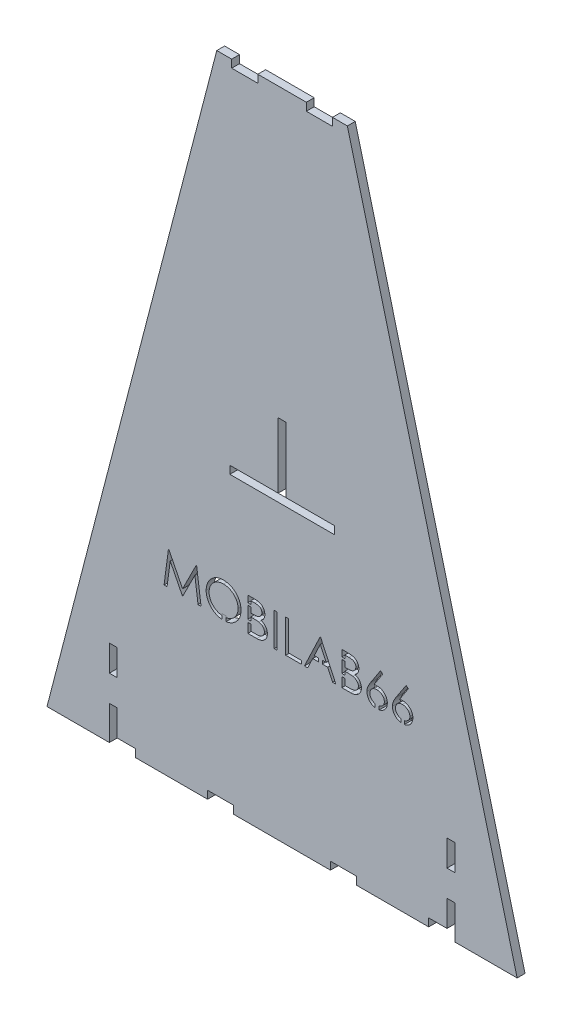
from build123d import *

# Parameters (mm, degrees)
BOSS_EXTRU_1_DEPTH      = 3
ESQUISSE2_W             = 3
ESQUISSE2_H             = 10
ENL_V_MAT_EXTRU_1_DEPTH = 248
ESQUISSE3_W             = 10
ESQUISSE3_H             = 3
ENL_V_MAT_EXTRU_2_DEPTH = 120
ESQUISSE4_W             = 1.13974359
ESQUISSE4_H             = 12.7
ENL_V_MAT_EXTRU_3_DEPTH = 3
ESQUISSE5_W             = 1.13974359
ESQUISSE5_H             = 0.825755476
ESQUISSE5_H_2           = 1.029626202
ESQUISSE5_W_2           = 1.139743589
ESQUISSE5_W_3           = 1.442397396
ESQUISSE5_H_3           = 1.302564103
ESQUISSE5_W_4           = 1.640062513
ESQUISSE5_H_4           = 2.510990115
ESQUISSE5_W_5           = 1.357293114
ESQUISSE5_W_6           = 1.601092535
ESQUISSE5_H_5           = 2.843057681
BOSS_EXTRU_2_DEPTH      = 3


with BuildPart() as part:
    # Esquisse1 → Boss.-Extru.1 (new body)
    with BuildSketch(Plane.XY):
        Polygon((-90, -20), (-66.130511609, -20), (-66.130511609, -17), (-56.130511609, -17), (-56.130511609, -20), (-28.511151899, -20), (-28.511151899, -17), (-18.511151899, -17), (-18.511151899, -20), (18.511151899, -20), (18.511151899, -17), (28.511151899, -17), (28.511151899, -20), (56.130511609, -20), (56.130511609, -17), (66.130511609, -17), (66.130511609, -20), (90, -20), (25, 230), (-25, 230), align=None)
        Polygon((-1.5, 120), (1.5, 120), (1.5, 95), (20, 95), (20, 92), (-20, 92), (-20, 95), (-1.5, 95), align=None, mode=Mode.SUBTRACT)
    extrude(amount=BOSS_EXTRU_1_DEPTH)

    # Esquisse2 → Enl_v. mat.-Extru.1 (cut, through all)
    with BuildSketch(Plane.XY.offset(3)):
        with Locations((-64.630511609, -12)):
            Rectangle(ESQUISSE2_W, ESQUISSE2_H)
        with Locations((-64.630511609, 8)):
            Rectangle(ESQUISSE2_W, ESQUISSE2_H)
        with Locations((64.630511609, 8)):
            Rectangle(ESQUISSE2_W, ESQUISSE2_H)
        with Locations((64.630511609, -12)):
            Rectangle(ESQUISSE2_W, ESQUISSE2_H)
    extrude(amount=-ENL_V_MAT_EXTRU_1_DEPTH, mode=Mode.SUBTRACT)

    # Esquisse3 → Enl_v. mat.-Extru.2 (cut)
    with BuildSketch(Plane.XY.offset(3)):
        with Locations((-14.289961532, 228.5)):
            Rectangle(ESQUISSE3_W, ESQUISSE3_H)
        with Locations((14.289961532, 228.5)):
            Rectangle(ESQUISSE3_W, ESQUISSE3_H)
    extrude(amount=-ENL_V_MAT_EXTRU_2_DEPTH, mode=Mode.SUBTRACT)

    # Esquisse4 → Enl_v. mat.-Extru.3 (cut)
    # profile 1 of 9: a face of its own
    with BuildSketch(Plane.XY.offset(3)):
        Polygon((-45.186989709, 42.699842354), (-43.510447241, 55.399842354), (-43.347626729, 55.399842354), (-38.104297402, 44.979329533), (-32.873688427, 55.399842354), (-32.708323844, 55.399842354), (-31.021605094, 42.699842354), (-32.166436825, 42.699842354), (-33.38250253, 51.838143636), (-37.966917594, 42.699842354), (-38.223868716, 42.699842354), (-42.826092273, 51.8584962), (-44.039613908, 42.699842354), align=None)
    # profile 2 of 9: a face of its own
    with BuildSketch(Plane.XY.offset(3)):
        with BuildLine():
            add(Edge.make_bspline(
                [(-22.473528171, 55.725483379), (-22.238367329, 55.719527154), (-21.776492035, 55.707828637), (-21.097677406, 55.618278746), (-20.449632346, 55.463355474), (-19.827077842, 55.257024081), (-19.23746047, 54.981781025), (-18.676342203, 54.649094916), (-18.145058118, 54.255480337), (-17.650769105, 53.803979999), (-17.198442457, 53.312731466), (-16.799931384, 52.78848305), (-16.465949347, 52.234404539), (-16.191680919, 51.652160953), (-15.976511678, 51.043069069), (-15.828034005, 50.403881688), (-15.733189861, 49.73874027), (-15.722101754, 49.285071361), (-15.716476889, 49.054930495)],
                knots=[0, 0, 0, 0, 1.065120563, 2.091984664, 3.0946048, 4.079830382, 5.057816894, 6.036188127, 7.030412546, 8.04752943, 9.064399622, 10.05169764, 11.02544977, 11.989514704, 12.962713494, 13.945757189, 14.957906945, 16, 16, 16, 16], degree=3))
            add(Edge.make_bspline(
                [(-15.716476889, 49.054930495), (-15.72210093, 48.826484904), (-15.733186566, 48.376192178), (-15.828141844, 47.715271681), (-15.977062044, 47.079942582), (-16.189682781, 46.471265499), (-16.462643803, 45.888598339), (-16.79884971, 45.333474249), (-17.194876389, 44.805711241), (-17.64556982, 44.311090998), (-18.136882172, 43.857528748), (-18.663860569, 43.462308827), (-19.214653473, 43.122224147), (-19.796348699, 42.850866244), (-20.40123169, 42.633979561), (-21.03471612, 42.486105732), (-21.693833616, 42.390721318), (-22.143308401, 42.379768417), (-22.37176535, 42.374201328)],
                knots=[0, 0, 0, 0, 1.043624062, 2.057103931, 3.04512605, 4.022047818, 4.998200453, 5.980619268, 6.982898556, 8.009068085, 9.034988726, 10.034168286, 11.015286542, 11.987931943, 12.962482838, 13.94673481, 14.956375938, 16, 16, 16, 16], degree=3))
            add(Edge.make_bspline(
                [(-22.37176535, 42.374201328), (-22.601905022, 42.379823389), (-23.055571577, 42.390905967), (-23.72154882, 42.485907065), (-24.361185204, 42.63446551), (-24.972651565, 42.846771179), (-25.556288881, 43.121153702), (-26.113238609, 43.455723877), (-26.641265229, 43.852715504), (-27.135990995, 44.303262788), (-27.588652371, 44.79374242), (-27.983293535, 45.31928386), (-28.317938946, 45.869576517), (-28.591400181, 46.446147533), (-28.807896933, 47.046209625), (-28.955597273, 47.673765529), (-29.051159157, 48.32523745), (-29.062171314, 48.768804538), (-29.06775894, 48.993872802)],
                knots=[0, 0, 0, 0, 1.053102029, 2.075944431, 3.073151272, 4.055350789, 5.033113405, 6.020478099, 7.024410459, 8.052272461, 9.079885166, 10.07527673, 11.055994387, 12.023226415, 12.992069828, 13.970394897, 14.97016774, 16, 16, 16, 16], degree=3))
            add(Edge.make_bspline(
                [(-29.06775894, 48.993872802), (-29.065818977, 49.144939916), (-29.061963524, 49.445168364), (-29.015547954, 49.890998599), (-28.948195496, 50.329658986), (-28.851668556, 50.75990214), (-28.725424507, 51.180674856), (-28.576464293, 51.594879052), (-28.394528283, 51.998317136), (-28.188858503, 52.3929003), (-27.959308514, 52.772477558), (-27.705759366, 53.131269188), (-27.437116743, 53.472285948), (-27.142609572, 53.786690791), (-26.831944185, 54.083630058), (-26.500080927, 54.358540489), (-26.149044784, 54.613901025), (-25.777325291, 54.844026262), (-25.394081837, 55.05215798), (-24.999014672, 55.230762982), (-24.597489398, 55.384055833), (-24.18762539, 55.508301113), (-23.770511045, 55.606388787), (-23.345235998, 55.673181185), (-22.912139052, 55.719715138), (-22.620360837, 55.72355236), (-22.473528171, 55.725483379)],
                knots=[0, 0, 0, 0, 1.037015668, 2.060948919, 3.074880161, 4.083647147, 5.086022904, 6.090072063, 7.104153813, 8.122640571, 9.144368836, 10.147691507, 11.138137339, 12.123020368, 13.103399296, 14.087645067, 15.080126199, 16.082011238, 17.087798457, 18.072939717, 19.057185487, 20.037253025, 21.01195951, 21.997135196, 22.992090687, 24, 24, 24, 24], degree=3))
        make_face()
        with BuildLine():
            add(Edge.make_bspline(
                [(-22.41755862, 54.422919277), (-22.53808029, 54.421450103), (-22.777971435, 54.418525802), (-23.134603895, 54.38000592), (-23.486546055, 54.325106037), (-23.833870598, 54.246795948), (-24.175124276, 54.140101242), (-24.513487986, 54.017307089), (-24.84587621, 53.867733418), (-25.171191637, 53.698741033), (-25.486569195, 53.511692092), (-25.784158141, 53.304965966), (-26.064728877, 53.083410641), (-26.327594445, 52.846509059), (-26.571982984, 52.59305479), (-26.802704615, 52.326890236), (-27.010511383, 52.04040766), (-27.200959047, 51.741375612), (-27.37138521, 51.430183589), (-27.522933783, 51.110107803), (-27.646900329, 50.77853734), (-27.748000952, 50.439069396), (-27.831820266, 50.092241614), (-27.884920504, 49.735422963), (-27.923863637, 49.370406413), (-27.926620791, 49.1237294), (-27.92801535, 48.998960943)],
                knots=[0, 0, 0, 0, 1.008559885, 2.007477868, 2.99961109, 3.989939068, 4.984837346, 5.991145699, 7.001802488, 8.033829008, 9.059044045, 10.069351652, 11.065060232, 12.050310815, 13.029377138, 14.011219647, 14.996725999, 15.989392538, 16.977580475, 17.965360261, 18.951710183, 19.937753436, 20.929683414, 21.935841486, 22.955955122, 24, 24, 24, 24], degree=3))
            add(Edge.make_bspline(
                [(-27.92801535, 48.998960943), (-27.923389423, 48.815492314), (-27.914288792, 48.454552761), (-27.83461418, 47.925622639), (-27.71188873, 47.417302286), (-27.530977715, 46.932373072), (-27.304734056, 46.466666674), (-27.025236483, 46.024314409), (-26.694096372, 45.605196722), (-26.317945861, 45.212239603), (-25.906746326, 44.853570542), (-25.47011042, 44.538743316), (-25.012715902, 44.272368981), (-24.533369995, 44.055362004), (-24.034631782, 43.883404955), (-23.513287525, 43.765553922), (-22.972810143, 43.687991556), (-22.604398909, 43.680542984), (-22.41755862, 43.676765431)],
                knots=[0, 0, 0, 0, 1.032063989, 2.030389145, 3.003944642, 3.970395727, 4.937377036, 5.913328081, 6.909231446, 7.93887556, 8.970685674, 9.976071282, 10.964166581, 11.944589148, 12.933237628, 13.927779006, 14.949070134, 16, 16, 16, 16], degree=3))
            add(Edge.make_bspline(
                [(-22.41755862, 43.676765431), (-22.291975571, 43.678490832), (-22.042906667, 43.681912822), (-21.672445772, 43.716379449), (-21.308658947, 43.771649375), (-20.952056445, 43.851226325), (-20.603042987, 43.950820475), (-20.260161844, 44.069139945), (-19.927065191, 44.216754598), (-19.599550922, 44.379851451), (-19.286055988, 44.565780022), (-18.986787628, 44.76548988), (-18.709289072, 44.986718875), (-18.446620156, 45.220100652), (-18.201228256, 45.4703409), (-17.974772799, 45.737114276), (-17.76801632, 46.022104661), (-17.577640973, 46.320683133), (-17.407811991, 46.632726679), (-17.259842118, 46.953962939), (-17.13430764, 47.283600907), (-17.032967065, 47.622116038), (-16.953554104, 47.968865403), (-16.898835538, 48.324313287), (-16.860559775, 48.687748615), (-16.857674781, 48.933562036), (-16.856220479, 49.057474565)],
                knots=[0, 0, 0, 0, 1.047197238, 2.076906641, 3.100256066, 4.114471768, 5.12198147, 6.126382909, 7.136867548, 8.15857795, 9.17633901, 10.174870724, 11.156907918, 12.133735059, 13.104061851, 14.077631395, 15.04955518, 16.038496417, 17.029181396, 18.010275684, 18.986308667, 19.968651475, 20.955262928, 21.950658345, 22.966943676, 24, 24, 24, 24], degree=3))
            add(Edge.make_bspline(
                [(-16.856220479, 49.057474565), (-16.857675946, 49.180539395), (-16.860563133, 49.424661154), (-16.898817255, 49.785561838), (-16.953611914, 50.138452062), (-17.032579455, 50.481946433), (-17.134361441, 50.81613251), (-17.25986404, 51.140696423), (-17.407856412, 51.456847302), (-17.577703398, 51.763803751), (-17.768623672, 52.058352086), (-17.97724564, 52.339937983), (-18.207171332, 52.603273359), (-18.45183148, 52.854859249), (-18.717337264, 53.089329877), (-19.002485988, 53.306763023), (-19.303815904, 53.512406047), (-19.622866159, 53.6979188), (-19.952137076, 53.869239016), (-20.290007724, 54.01601837), (-20.632650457, 54.14074006), (-20.97919395, 54.247118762), (-21.332555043, 54.324799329), (-21.690346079, 54.380055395), (-22.052072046, 54.418512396), (-22.295343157, 54.421445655), (-22.41755862, 54.422919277)],
                knots=[0, 0, 0, 0, 1.02996197, 2.043119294, 3.035359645, 4.018872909, 4.991431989, 5.957985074, 6.929999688, 7.912076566, 8.892894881, 9.867085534, 10.843653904, 11.817741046, 12.803660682, 13.806313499, 14.818574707, 15.856120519, 16.894564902, 17.924820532, 18.937903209, 19.946497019, 20.957711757, 21.963978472, 22.977135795, 24, 24, 24, 24], degree=3))
        make_face(mode=Mode.SUBTRACT)
    # profile 3 of 9: a face of its own
    with BuildSketch(Plane.XY.offset(3)):
        with BuildLine():
            Line((-13.111348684, 55.399842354), (-10.633424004, 55.399842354))
            add(Edge.make_bspline(
                [(-10.633424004, 55.399842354), (-10.512126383, 55.399204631), (-10.277021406, 55.397968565), (-9.935139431, 55.378798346), (-9.614922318, 55.352659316), (-9.316277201, 55.311184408), (-9.039342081, 55.26113996), (-8.783282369, 55.200536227), (-8.548912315, 55.127868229), (-8.269103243, 55.012311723), (-7.950076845, 54.840596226), (-7.604642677, 54.586855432), (-7.30926158, 54.276494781), (-7.054585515, 53.926400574), (-6.852107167, 53.541279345), (-6.705624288, 53.130310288), (-6.612885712, 52.698794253), (-6.60334825, 52.402546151), (-6.598528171, 52.252827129)],
                knots=[0, 0, 0, 0, 1.001505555, 1.941167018, 2.826882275, 3.653841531, 4.429895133, 5.150066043, 5.825578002, 6.45369114, 7.647487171, 8.808567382, 9.977351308, 11.170798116, 12.373658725, 13.556498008, 14.765093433, 16, 16, 16, 16], degree=3))
            add(Edge.make_bspline(
                [(-6.598528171, 52.252827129), (-6.602494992, 52.11257357), (-6.61029017, 51.8369621), (-6.684831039, 51.433849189), (-6.801528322, 51.050123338), (-6.963744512, 50.687184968), (-7.174571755, 50.353234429), (-7.424429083, 50.045577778), (-7.725879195, 49.777241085), (-7.951733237, 49.62722541), (-8.066456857, 49.551024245)],
                knots=[0, 0, 0, 0, 1.044552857, 2.05264487, 3.044412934, 4.028983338, 5.005914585, 5.980388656, 6.974128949, 8, 8, 8, 8], degree=3))
            add(Edge.make_bspline(
                [(-8.066456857, 49.551024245), (-7.922183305, 49.495634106), (-7.646152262, 49.389659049), (-7.266291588, 49.202296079), (-6.939013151, 48.99850785), (-6.661800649, 48.775960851), (-6.424718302, 48.536080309), (-6.217697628, 48.275348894), (-6.041053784, 47.990365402), (-5.889695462, 47.684101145), (-5.771589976, 47.359683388), (-5.683140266, 47.020155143), (-5.632458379, 46.6667339), (-5.62524608, 46.426212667), (-5.621605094, 46.30479027)],
                knots=[0, 0, 0, 0, 1.27268992, 2.434971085, 3.483601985, 4.442670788, 5.356604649, 6.2567628, 7.179492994, 8.113709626, 9.066344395, 10.018646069, 10.999752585, 12, 12, 12, 12], degree=3))
            add(Edge.make_bspline(
                [(-5.621605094, 46.30479027), (-5.625149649, 46.180813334), (-5.632123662, 45.936885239), (-5.683576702, 45.57854518), (-5.770695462, 45.236098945), (-5.890696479, 44.907331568), (-6.04731402, 44.59287908), (-6.237915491, 44.292385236), (-6.465178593, 44.008869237), (-6.719406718, 43.739180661), (-7.007015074, 43.496691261), (-7.317315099, 43.280734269), (-7.654214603, 43.103129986), (-8.01218041, 42.953937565), (-8.395228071, 42.839974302), (-8.801637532, 42.760245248), (-9.231058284, 42.706524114), (-9.525733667, 42.702107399), (-9.676853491, 42.699842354)],
                knots=[0, 0, 0, 0, 0.978564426, 1.925352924, 2.850884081, 3.763762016, 4.682927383, 5.618979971, 6.567305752, 7.547517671, 8.540179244, 9.531824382, 10.526200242, 11.540722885, 12.589160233, 13.674978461, 14.80764778, 16, 16, 16, 16], degree=3))
            Line((-9.676853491, 42.699842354), (-13.111348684, 42.699842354))
            Line((-13.111348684, 42.699842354), (-13.111348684, 55.399842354))
        make_face()
        with BuildLine():
            Line((-11.971605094, 54.097278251), (-11.971605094, 50.026765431))
            Line((-11.971605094, 50.026765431), (-11.20583987, 50.026765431))
            add(Edge.make_bspline(
                [(-11.20583987, 50.026765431), (-11.093902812, 50.02821658), (-10.877617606, 50.031020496), (-10.564399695, 50.0390524), (-10.273660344, 50.061542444), (-10.005901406, 50.084026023), (-9.761544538, 50.120582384), (-9.541131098, 50.164096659), (-9.341201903, 50.210117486), (-9.110644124, 50.28838391), (-8.849122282, 50.404054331), (-8.570327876, 50.583566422), (-8.324548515, 50.797377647), (-8.117004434, 51.044087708), (-7.947145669, 51.315745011), (-7.829167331, 51.60801512), (-7.749167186, 51.913613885), (-7.741940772, 52.123411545), (-7.738271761, 52.229930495)],
                knots=[0, 0, 0, 0, 1.156816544, 2.235205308, 3.236616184, 4.169592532, 5.011045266, 5.787822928, 6.49130361, 7.128639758, 8.301311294, 9.436451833, 10.541879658, 11.654887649, 12.756523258, 13.837046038, 14.901820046, 16, 16, 16, 16], degree=3))
            add(Edge.make_bspline(
                [(-7.738271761, 52.229930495), (-7.740181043, 52.300418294), (-7.743926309, 52.43868781), (-7.774599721, 52.640252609), (-7.826733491, 52.829822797), (-7.893696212, 53.009996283), (-7.987272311, 53.175139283), (-8.097448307, 53.330961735), (-8.230564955, 53.472157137), (-8.382084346, 53.604126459), (-8.556287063, 53.721128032), (-8.753069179, 53.823601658), (-8.975093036, 53.906118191), (-9.218616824, 53.978385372), (-9.487389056, 54.029142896), (-9.77830815, 54.071428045), (-10.093756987, 54.092955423), (-10.311997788, 54.095805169), (-10.424810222, 54.097278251)],
                knots=[0, 0, 0, 0, 0.91205012, 1.789085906, 2.630437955, 3.453916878, 4.269457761, 5.079663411, 5.91843418, 6.774407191, 7.675494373, 8.627863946, 9.638891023, 10.736472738, 11.911756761, 13.175263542, 14.539845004, 16, 16, 16, 16], degree=3))
            Line((-10.424810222, 54.097278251), (-11.971605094, 54.097278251))
        make_face(mode=Mode.SUBTRACT)
        with BuildLine():
            Line((-11.971605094, 48.724201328), (-11.971605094, 44.002406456))
            Line((-11.971605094, 44.002406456), (-10.348488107, 44.002406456))
            add(Edge.make_bspline(
                [(-10.348488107, 44.002406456), (-10.232305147, 44.003798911), (-10.008377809, 44.006482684), (-9.685067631, 44.015244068), (-9.38540894, 44.035173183), (-9.110769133, 44.066545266), (-8.858182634, 44.100575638), (-8.63067954, 44.146336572), (-8.426415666, 44.198765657), (-8.189563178, 44.279806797), (-7.922850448, 44.40570542), (-7.635428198, 44.595531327), (-7.379881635, 44.821675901), (-7.16287398, 45.083408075), (-6.98502685, 45.368001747), (-6.855648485, 45.669700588), (-6.77585309, 45.983519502), (-6.766193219, 46.19748443), (-6.761348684, 46.30479027)],
                knots=[0, 0, 0, 0, 1.160039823, 2.235823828, 3.228722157, 4.157150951, 4.99529583, 5.772374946, 6.472645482, 7.099169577, 8.269452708, 9.405989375, 10.527446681, 11.663510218, 12.788923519, 13.866172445, 14.929861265, 16, 16, 16, 16], degree=3))
            add(Edge.make_bspline(
                [(-6.761348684, 46.30479027), (-6.762350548, 46.371894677), (-6.764338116, 46.505021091), (-6.794312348, 46.700658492), (-6.837905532, 46.890163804), (-6.89426245, 47.074051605), (-6.976338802, 47.248997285), (-7.072156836, 47.418460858), (-7.184502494, 47.582666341), (-7.359559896, 47.790265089), (-7.614183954, 48.029449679), (-7.97597711, 48.263628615), (-8.387356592, 48.452487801), (-8.685724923, 48.53267733), (-8.839854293, 48.574101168)],
                knots=[0, 0, 0, 0, 0.723448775, 1.435228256, 2.130040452, 2.821711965, 3.505591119, 4.210454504, 4.921174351, 5.648778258, 7.137944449, 8.670945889, 10.280296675, 12, 12, 12, 12], degree=3))
            add(Edge.make_bspline(
                [(-8.839854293, 48.574101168), (-8.901645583, 48.586638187), (-9.035621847, 48.61382103), (-9.254089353, 48.642514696), (-9.503502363, 48.668078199), (-9.784436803, 48.686987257), (-10.097248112, 48.706532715), (-10.44260436, 48.714133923), (-10.819095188, 48.723202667), (-11.080324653, 48.723859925), (-11.216016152, 48.724201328)],
                knots=[0, 0, 0, 0, 0.634451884, 1.375622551, 2.216452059, 3.157844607, 4.20941857, 5.370758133, 6.634282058, 8, 8, 8, 8], degree=3))
            Line((-11.216016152, 48.724201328), (-11.971605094, 48.724201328))
        make_face(mode=Mode.SUBTRACT)
    # profile 4 of 9: a face of its own
    with BuildSketch(Plane.XY.offset(3)):
        with Locations((-2.446605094, 49.049842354)):
            Rectangle(ESQUISSE4_W, ESQUISSE4_H)
    # profile 5 of 9: a face of its own
    with BuildSketch(Plane.XY.offset(3)):
        Polygon((1.379676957, 55.399842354), (2.519420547, 55.399842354), (2.519420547, 44.002406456), (7.404035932, 44.002406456), (7.404035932, 42.699842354), (1.379676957, 42.699842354), align=None)
    # profile 6 of 9: a face of its own
    with BuildSketch(Plane.XY.offset(3)):
        Polygon((14.730959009, 55.399842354), (20.59249747, 42.699842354), (19.35353513, 42.699842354), (17.476011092, 46.770355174), (11.718779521, 46.770355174), (9.787830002, 42.699842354), (8.543779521, 42.699842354), (14.568138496, 55.399842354), align=None)
        Polygon((14.6368284, 52.924461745), (12.336988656, 48.072919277), (16.875610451, 48.072919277), align=None, mode=Mode.SUBTRACT)
    # profile 7 of 9: a face of its own
    with BuildSketch(Plane.XY.offset(3)):
        with BuildLine():
            Line((22.87198465, 55.399842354), (25.349909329, 55.399842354))
            add(Edge.make_bspline(
                [(25.349909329, 55.399842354), (25.47120695, 55.399204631), (25.706311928, 55.397968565), (26.048193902, 55.378798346), (26.368411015, 55.352659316), (26.667056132, 55.311184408), (26.943991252, 55.26113996), (27.200050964, 55.200536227), (27.434421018, 55.127868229), (27.71423009, 55.012311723), (28.033256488, 54.840596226), (28.378690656, 54.586855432), (28.674071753, 54.276494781), (28.928747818, 53.926400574), (29.131226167, 53.541279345), (29.277709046, 53.130310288), (29.370447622, 52.698794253), (29.379985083, 52.402546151), (29.384805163, 52.252827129)],
                knots=[0, 0, 0, 0, 1.001505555, 1.941167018, 2.826882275, 3.653841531, 4.429895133, 5.150066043, 5.825578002, 6.45369114, 7.647487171, 8.808567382, 9.977351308, 11.170798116, 12.373658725, 13.556498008, 14.765093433, 16, 16, 16, 16], degree=3))
            add(Edge.make_bspline(
                [(29.384805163, 52.252827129), (29.380838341, 52.11257357), (29.373043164, 51.8369621), (29.298502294, 51.433849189), (29.181805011, 51.050123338), (29.019588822, 50.687184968), (28.808761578, 50.353234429), (28.55890425, 50.045577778), (28.257454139, 49.777241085), (28.031600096, 49.62722541), (27.916876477, 49.551024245)],
                knots=[0, 0, 0, 0, 1.044552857, 2.05264487, 3.044412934, 4.028983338, 5.005914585, 5.980388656, 6.974128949, 8, 8, 8, 8], degree=3))
            add(Edge.make_bspline(
                [(27.916876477, 49.551024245), (28.061150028, 49.495634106), (28.337181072, 49.389659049), (28.717041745, 49.202296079), (29.044320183, 48.99850785), (29.321532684, 48.775960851), (29.558615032, 48.536080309), (29.765635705, 48.275348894), (29.942279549, 47.990365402), (30.093637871, 47.684101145), (30.211743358, 47.359683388), (30.300193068, 47.020155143), (30.350874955, 46.6667339), (30.358087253, 46.426212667), (30.361728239, 46.30479027)],
                knots=[0, 0, 0, 0, 1.27268992, 2.434971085, 3.483601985, 4.442670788, 5.356604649, 6.2567628, 7.179492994, 8.113709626, 9.066344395, 10.018646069, 10.999752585, 12, 12, 12, 12], degree=3))
            add(Edge.make_bspline(
                [(30.361728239, 46.30479027), (30.358183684, 46.180813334), (30.351209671, 45.936885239), (30.299756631, 45.57854518), (30.212637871, 45.236098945), (30.092636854, 44.907331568), (29.936019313, 44.59287908), (29.745417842, 44.292385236), (29.51815474, 44.008869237), (29.263926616, 43.739180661), (28.976318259, 43.496691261), (28.666018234, 43.280734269), (28.329118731, 43.103129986), (27.971152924, 42.953937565), (27.588105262, 42.839974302), (27.181695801, 42.760245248), (26.752275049, 42.706524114), (26.457599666, 42.702107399), (26.306479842, 42.699842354)],
                knots=[0, 0, 0, 0, 0.978564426, 1.925352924, 2.850884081, 3.763762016, 4.682927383, 5.618979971, 6.567305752, 7.547517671, 8.540179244, 9.531824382, 10.526200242, 11.540722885, 12.589160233, 13.674978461, 14.80764778, 16, 16, 16, 16], degree=3))
            Line((26.306479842, 42.699842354), (22.87198465, 42.699842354))
            Line((22.87198465, 42.699842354), (22.87198465, 55.399842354))
        make_face()
        with BuildLine():
            Line((24.011728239, 54.097278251), (24.011728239, 50.026765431))
            Line((24.011728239, 50.026765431), (24.777493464, 50.026765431))
            add(Edge.make_bspline(
                [(24.777493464, 50.026765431), (24.889430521, 50.02821658), (25.105715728, 50.031020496), (25.418933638, 50.0390524), (25.70967299, 50.061542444), (25.977431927, 50.084026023), (26.221788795, 50.120582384), (26.442202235, 50.164096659), (26.64213143, 50.210117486), (26.87268921, 50.28838391), (27.134211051, 50.404054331), (27.413005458, 50.583566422), (27.658784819, 50.797377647), (27.8663289, 51.044087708), (28.036187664, 51.315745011), (28.154166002, 51.60801512), (28.234166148, 51.913613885), (28.241392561, 52.123411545), (28.245061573, 52.229930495)],
                knots=[0, 0, 0, 0, 1.156816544, 2.235205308, 3.236616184, 4.169592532, 5.011045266, 5.787822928, 6.49130361, 7.128639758, 8.301311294, 9.436451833, 10.541879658, 11.654887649, 12.756523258, 13.837046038, 14.901820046, 16, 16, 16, 16], degree=3))
            add(Edge.make_bspline(
                [(28.245061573, 52.229930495), (28.24315229, 52.300418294), (28.239407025, 52.43868781), (28.208733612, 52.640252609), (28.156599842, 52.829822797), (28.089637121, 53.009996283), (27.996061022, 53.175139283), (27.885885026, 53.330961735), (27.752768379, 53.472157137), (27.601248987, 53.604126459), (27.42704627, 53.721128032), (27.230264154, 53.823601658), (27.008240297, 53.906118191), (26.764716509, 53.978385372), (26.495944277, 54.029142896), (26.205025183, 54.071428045), (25.889576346, 54.092955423), (25.671335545, 54.095805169), (25.558523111, 54.097278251)],
                knots=[0, 0, 0, 0, 0.91205012, 1.789085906, 2.630437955, 3.453916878, 4.269457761, 5.079663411, 5.91843418, 6.774407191, 7.675494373, 8.627863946, 9.638891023, 10.736472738, 11.911756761, 13.175263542, 14.539845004, 16, 16, 16, 16], degree=3))
            Line((25.558523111, 54.097278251), (24.011728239, 54.097278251))
        make_face(mode=Mode.SUBTRACT)
        with BuildLine():
            Line((24.011728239, 48.724201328), (24.011728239, 44.002406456))
            Line((24.011728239, 44.002406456), (25.634845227, 44.002406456))
            add(Edge.make_bspline(
                [(25.634845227, 44.002406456), (25.751028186, 44.003798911), (25.974955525, 44.006482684), (26.298265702, 44.015244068), (26.597924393, 44.035173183), (26.8725642, 44.066545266), (27.1251507, 44.100575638), (27.352653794, 44.146336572), (27.556917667, 44.198765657), (27.793770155, 44.279806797), (28.060482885, 44.40570542), (28.347905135, 44.595531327), (28.603451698, 44.821675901), (28.820459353, 45.083408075), (28.998306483, 45.368001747), (29.127684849, 45.669700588), (29.207480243, 45.983519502), (29.217140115, 46.19748443), (29.22198465, 46.30479027)],
                knots=[0, 0, 0, 0, 1.160039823, 2.235823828, 3.228722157, 4.157150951, 4.99529583, 5.772374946, 6.472645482, 7.099169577, 8.269452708, 9.405989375, 10.527446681, 11.663510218, 12.788923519, 13.866172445, 14.929861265, 16, 16, 16, 16], degree=3))
            add(Edge.make_bspline(
                [(29.22198465, 46.30479027), (29.220982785, 46.371894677), (29.218995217, 46.505021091), (29.189020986, 46.700658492), (29.145427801, 46.890163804), (29.089070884, 47.074051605), (29.006994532, 47.248997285), (28.911176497, 47.418460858), (28.79883084, 47.582666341), (28.623773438, 47.790265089), (28.36914938, 48.029449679), (28.007356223, 48.263628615), (27.595976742, 48.452487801), (27.29760841, 48.53267733), (27.143479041, 48.574101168)],
                knots=[0, 0, 0, 0, 0.723448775, 1.435228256, 2.130040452, 2.821711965, 3.505591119, 4.210454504, 4.921174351, 5.648778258, 7.137944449, 8.670945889, 10.280296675, 12, 12, 12, 12], degree=3))
            add(Edge.make_bspline(
                [(27.143479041, 48.574101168), (27.08168775, 48.586638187), (26.947711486, 48.61382103), (26.72924398, 48.642514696), (26.47983097, 48.668078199), (26.19889653, 48.686987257), (25.886085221, 48.706532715), (25.540728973, 48.714133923), (25.164238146, 48.723202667), (24.90300868, 48.723859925), (24.767317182, 48.724201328)],
                knots=[0, 0, 0, 0, 0.634451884, 1.375622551, 2.216452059, 3.157844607, 4.20941857, 5.370758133, 6.634282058, 8, 8, 8, 8], degree=3))
            Line((24.767317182, 48.724201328), (24.011728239, 48.724201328))
        make_face(mode=Mode.SUBTRACT)
    # profile 8 of 9: a face of its own
    with BuildSketch(Plane.XY.offset(3)):
        with BuildLine():
            Line((37.688651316, 55.725483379), (38.566355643, 55.03604027))
            Line((38.566355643, 55.03604027), (35.210726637, 49.904650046))
            add(Edge.make_bspline(
                [(35.210726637, 49.904650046), (35.434138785, 49.94026034), (35.86992944, 50.009722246), (36.311039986, 50.021181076), (36.526011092, 50.026765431)],
                knots=[0, 0, 0, 0, 1.025318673, 2, 2, 2, 2], degree=3))
            add(Edge.make_bspline(
                [(36.526011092, 50.026765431), (36.655088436, 50.023296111), (36.909173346, 50.016466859), (37.282215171, 49.963911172), (37.640677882, 49.881088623), (37.983075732, 49.760357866), (38.310637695, 49.606135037), (38.625243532, 49.421299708), (38.920979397, 49.196307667), (39.201653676, 48.944974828), (39.456477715, 48.66660177), (39.682087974, 48.371231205), (39.871596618, 48.059170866), (40.025353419, 47.730578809), (40.144751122, 47.385961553), (40.231792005, 47.025760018), (40.283243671, 46.649725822), (40.290230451, 46.393990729), (40.293779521, 46.264085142)],
                knots=[0, 0, 0, 0, 1.04369286, 2.054478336, 3.041073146, 4.015093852, 4.984733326, 5.965804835, 6.960378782, 7.985147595, 9.009457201, 10.008161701, 10.986880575, 11.956520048, 12.937015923, 13.931873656, 14.949455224, 16, 16, 16, 16], degree=3))
            add(Edge.make_bspline(
                [(40.293779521, 46.264085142), (40.288615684, 46.086358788), (40.278454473, 45.736635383), (40.177203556, 45.227268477), (40.019869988, 44.742010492), (39.794980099, 44.288608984), (39.515644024, 43.867685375), (39.175002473, 43.494720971), (38.785136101, 43.162089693), (38.344312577, 42.883935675), (37.869902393, 42.656776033), (37.371510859, 42.49361644), (36.853978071, 42.393164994), (36.502715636, 42.380571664), (36.325029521, 42.374201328)],
                knots=[0, 0, 0, 0, 1.031375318, 2.029502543, 3.004789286, 3.987476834, 4.960371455, 5.9300674, 6.912260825, 7.929083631, 8.949397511, 9.960523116, 10.96833055, 12, 12, 12, 12], degree=3))
            add(Edge.make_bspline(
                [(36.325029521, 42.374201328), (36.154135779, 42.379746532), (35.815625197, 42.390730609), (35.3176662, 42.488578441), (34.839191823, 42.647172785), (34.383554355, 42.865664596), (33.961476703, 43.141646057), (33.583867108, 43.473886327), (33.252608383, 43.855283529), (32.976929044, 44.285778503), (32.758275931, 44.748384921), (32.59430106, 45.230756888), (32.498520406, 45.731136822), (32.485136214, 46.070339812), (32.478394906, 46.241188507)],
                knots=[0, 0, 0, 0, 1.012016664, 2.004627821, 2.994792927, 3.992885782, 4.990978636, 5.973936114, 6.964471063, 7.975201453, 8.993600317, 9.990122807, 10.98767138, 12, 12, 12, 12], degree=3))
            add(Edge.make_bspline(
                [(32.478394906, 46.241188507), (32.482681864, 46.371978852), (32.491435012, 46.639027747), (32.552552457, 47.043482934), (32.650758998, 47.45732543), (32.760741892, 47.808404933), (32.876949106, 48.096011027), (32.973659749, 48.327889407), (33.094033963, 48.566508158), (33.222388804, 48.820049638), (33.370278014, 49.081979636), (33.531080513, 49.356675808), (33.709242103, 49.639769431), (33.834138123, 49.831881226), (33.897986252, 49.930090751)],
                knots=[0, 0, 0, 0, 1.173818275, 2.396712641, 3.66331629, 4.989737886, 5.693666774, 6.447286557, 7.243889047, 8.091586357, 8.998013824, 9.943181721, 10.948533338, 12, 12, 12, 12], degree=3))
            Line((33.897986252, 49.930090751), (37.688651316, 55.725483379))
        make_face()
        with BuildLine():
            add(Edge.make_bspline(
                [(36.286868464, 48.724201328), (36.190122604, 48.721378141), (36.001149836, 48.715863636), (35.723900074, 48.683840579), (35.461506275, 48.623537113), (35.210492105, 48.546733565), (34.97555044, 48.441131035), (34.754973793, 48.312854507), (34.547909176, 48.161829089), (34.356525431, 47.990194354), (34.183008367, 47.802277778), (34.033579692, 47.601002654), (33.904684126, 47.391219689), (33.799884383, 47.17117607), (33.718277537, 46.940955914), (33.659247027, 46.701618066), (33.626394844, 46.451557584), (33.620929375, 46.28198536), (33.618138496, 46.195395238)],
                knots=[0, 0, 0, 0, 1.129588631, 2.206414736, 3.251139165, 4.268635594, 5.265702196, 6.250456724, 7.242448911, 8.251968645, 9.246821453, 10.222880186, 11.173611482, 12.116736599, 13.062300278, 14.020270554, 14.989073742, 16, 16, 16, 16], degree=3))
            add(Edge.make_bspline(
                [(33.618138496, 46.195395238), (33.620411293, 46.109579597), (33.624867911, 45.9413079), (33.6653349, 45.693334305), (33.727147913, 45.454701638), (33.819097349, 45.226640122), (33.928777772, 45.005673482), (34.073577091, 44.799805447), (34.234020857, 44.596532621), (34.42580513, 44.411470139), (34.631629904, 44.239270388), (34.851525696, 44.088756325), (35.080706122, 43.959992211), (35.322265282, 43.859077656), (35.572775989, 43.776258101), (35.834325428, 43.717977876), (36.107095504, 43.685028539), (36.291869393, 43.679555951), (36.386087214, 43.676765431)],
                knots=[0, 0, 0, 0, 0.989467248, 1.94019797, 2.891935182, 3.827694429, 4.772920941, 5.730924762, 6.725747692, 7.756678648, 8.79901574, 9.819492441, 10.826891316, 11.826466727, 12.835195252, 13.867842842, 14.912794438, 16, 16, 16, 16], degree=3))
            add(Edge.make_bspline(
                [(36.386087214, 43.676765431), (36.48030488, 43.67955617), (36.665078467, 43.685029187), (36.937850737, 43.717975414), (37.199392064, 43.776267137), (37.449932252, 43.859044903), (37.691382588, 43.960113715), (37.920362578, 44.087955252), (38.138178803, 44.240196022), (38.344138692, 44.411175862), (38.535124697, 44.597585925), (38.699416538, 44.797990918), (38.839781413, 45.007337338), (38.953842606, 45.225769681), (39.044779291, 45.454839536), (39.106905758, 45.693297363), (39.147289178, 45.941317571), (39.151757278, 46.109582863), (39.154035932, 46.195395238)],
                knots=[0, 0, 0, 0, 1.087397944, 2.132534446, 3.165364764, 4.174271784, 5.174024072, 6.181601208, 7.194203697, 8.236725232, 9.267838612, 10.269026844, 11.221737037, 12.171628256, 13.107553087, 14.05945871, 15.010357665, 16, 16, 16, 16], degree=3))
            add(Edge.make_bspline(
                [(39.154035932, 46.195395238), (39.152039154, 46.282098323), (39.14812013, 46.452268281), (39.103793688, 46.70150621), (39.042317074, 46.942171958), (38.94948722, 47.172752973), (38.828886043, 47.392339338), (38.681989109, 47.60204029), (38.512053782, 47.80346355), (38.315756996, 47.990562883), (38.102069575, 48.161639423), (37.874864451, 48.312658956), (37.63716409, 48.440112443), (37.389209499, 48.546455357), (37.12815961, 48.623197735), (36.858228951, 48.683625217), (36.575965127, 48.715781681), (36.384461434, 48.721359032), (36.286868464, 48.724201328)],
                knots=[0, 0, 0, 0, 0.978206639, 1.919901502, 2.851605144, 3.780102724, 4.718870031, 5.675451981, 6.667674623, 7.690630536, 8.733308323, 9.756129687, 10.767539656, 11.776269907, 12.797430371, 13.836405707, 14.897401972, 16, 16, 16, 16], degree=3))
        make_face(mode=Mode.SUBTRACT)
    # profile 9 of 9: a face of its own
    with BuildSketch(Plane.XY.offset(3)):
        with BuildLine():
            Line((47.457882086, 55.725483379), (48.335586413, 55.03604027))
            Line((48.335586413, 55.03604027), (44.979957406, 49.904650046))
            add(Edge.make_bspline(
                [(44.979957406, 49.904650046), (45.203369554, 49.94026034), (45.639160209, 50.009722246), (46.080270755, 50.021181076), (46.295241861, 50.026765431)],
                knots=[0, 0, 0, 0, 1.025318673, 2, 2, 2, 2], degree=3))
            add(Edge.make_bspline(
                [(46.295241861, 50.026765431), (46.424319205, 50.023296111), (46.678404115, 50.016466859), (47.05144594, 49.963911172), (47.409908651, 49.881088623), (47.752306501, 49.760357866), (48.079868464, 49.606135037), (48.394474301, 49.421299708), (48.690210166, 49.196307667), (48.970884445, 48.944974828), (49.225708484, 48.66660177), (49.451318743, 48.371231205), (49.640827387, 48.059170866), (49.794584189, 47.730578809), (49.913981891, 47.385961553), (50.001022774, 47.025760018), (50.05247444, 46.649725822), (50.05946122, 46.393990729), (50.063010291, 46.264085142)],
                knots=[0, 0, 0, 0, 1.04369286, 2.054478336, 3.041073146, 4.015093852, 4.984733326, 5.965804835, 6.960378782, 7.985147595, 9.009457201, 10.008161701, 10.986880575, 11.956520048, 12.937015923, 13.931873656, 14.949455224, 16, 16, 16, 16], degree=3))
            add(Edge.make_bspline(
                [(50.063010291, 46.264085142), (50.057846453, 46.086358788), (50.047685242, 45.736635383), (49.946434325, 45.227268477), (49.789100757, 44.742010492), (49.564210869, 44.288608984), (49.284874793, 43.867685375), (48.944233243, 43.494720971), (48.554366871, 43.162089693), (48.113543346, 42.883935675), (47.639133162, 42.656776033), (47.140741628, 42.49361644), (46.62320884, 42.393164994), (46.271946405, 42.380571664), (46.094260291, 42.374201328)],
                knots=[0, 0, 0, 0, 1.031375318, 2.029502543, 3.004789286, 3.987476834, 4.960371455, 5.9300674, 6.912260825, 7.929083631, 8.949397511, 9.960523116, 10.96833055, 12, 12, 12, 12], degree=3))
            add(Edge.make_bspline(
                [(46.094260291, 42.374201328), (45.923366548, 42.379746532), (45.584855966, 42.390730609), (45.08689697, 42.488578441), (44.608422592, 42.647172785), (44.152785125, 42.865664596), (43.730707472, 43.141646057), (43.353097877, 43.473886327), (43.021839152, 43.855283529), (42.746159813, 44.285778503), (42.5275067, 44.748384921), (42.363531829, 45.230756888), (42.267751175, 45.731136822), (42.254366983, 46.070339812), (42.247625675, 46.241188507)],
                knots=[0, 0, 0, 0, 1.012016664, 2.004627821, 2.994792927, 3.992885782, 4.990978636, 5.973936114, 6.964471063, 7.975201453, 8.993600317, 9.990122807, 10.98767138, 12, 12, 12, 12], degree=3))
            add(Edge.make_bspline(
                [(42.247625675, 46.241188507), (42.251912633, 46.371978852), (42.260665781, 46.639027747), (42.321783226, 47.043482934), (42.419989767, 47.45732543), (42.529972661, 47.808404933), (42.646179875, 48.096011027), (42.742890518, 48.327889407), (42.863264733, 48.566508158), (42.991619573, 48.820049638), (43.139508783, 49.081979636), (43.300311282, 49.356675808), (43.478472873, 49.639769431), (43.603368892, 49.831881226), (43.667217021, 49.930090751)],
                knots=[0, 0, 0, 0, 1.173818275, 2.396712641, 3.66331629, 4.989737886, 5.693666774, 6.447286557, 7.243889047, 8.091586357, 8.998013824, 9.943181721, 10.948533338, 12, 12, 12, 12], degree=3))
            Line((43.667217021, 49.930090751), (47.457882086, 55.725483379))
        make_face()
        with BuildLine():
            add(Edge.make_bspline(
                [(46.056099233, 48.724201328), (45.959353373, 48.721378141), (45.770380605, 48.715863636), (45.493130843, 48.683840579), (45.230737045, 48.623537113), (44.979722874, 48.546733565), (44.744781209, 48.441131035), (44.524204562, 48.312854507), (44.317139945, 48.161829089), (44.1257562, 47.990194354), (43.952239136, 47.802277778), (43.802810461, 47.601002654), (43.673914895, 47.391219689), (43.569115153, 47.17117607), (43.487508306, 46.940955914), (43.428477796, 46.701618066), (43.395625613, 46.451557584), (43.390160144, 46.28198536), (43.387369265, 46.195395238)],
                knots=[0, 0, 0, 0, 1.129588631, 2.206414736, 3.251139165, 4.268635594, 5.265702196, 6.250456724, 7.242448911, 8.251968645, 9.246821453, 10.222880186, 11.173611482, 12.116736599, 13.062300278, 14.020270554, 14.989073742, 16, 16, 16, 16], degree=3))
            add(Edge.make_bspline(
                [(43.387369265, 46.195395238), (43.389642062, 46.109579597), (43.39409868, 45.9413079), (43.434565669, 45.693334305), (43.496378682, 45.454701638), (43.588328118, 45.226640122), (43.698008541, 45.005673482), (43.84280786, 44.799805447), (44.003251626, 44.596532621), (44.195035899, 44.411470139), (44.400860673, 44.239270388), (44.620756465, 44.088756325), (44.849936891, 43.959992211), (45.091496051, 43.859077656), (45.342006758, 43.776258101), (45.603556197, 43.717977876), (45.876326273, 43.685028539), (46.061100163, 43.679555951), (46.155317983, 43.676765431)],
                knots=[0, 0, 0, 0, 0.989467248, 1.94019797, 2.891935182, 3.827694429, 4.772920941, 5.730924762, 6.725747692, 7.756678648, 8.79901574, 9.819492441, 10.826891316, 11.826466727, 12.835195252, 13.867842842, 14.912794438, 16, 16, 16, 16], degree=3))
            add(Edge.make_bspline(
                [(46.155317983, 43.676765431), (46.249535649, 43.67955617), (46.434309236, 43.685029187), (46.707081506, 43.717975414), (46.968622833, 43.776267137), (47.219163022, 43.859044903), (47.460613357, 43.960113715), (47.689593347, 44.087955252), (47.907409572, 44.240196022), (48.113369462, 44.411175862), (48.304355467, 44.597585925), (48.468647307, 44.797990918), (48.609012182, 45.007337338), (48.723073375, 45.225769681), (48.814010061, 45.454839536), (48.876136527, 45.693297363), (48.916519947, 45.941317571), (48.920988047, 46.109582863), (48.923266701, 46.195395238)],
                knots=[0, 0, 0, 0, 1.087397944, 2.132534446, 3.165364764, 4.174271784, 5.174024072, 6.181601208, 7.194203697, 8.236725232, 9.267838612, 10.269026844, 11.221737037, 12.171628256, 13.107553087, 14.05945871, 15.010357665, 16, 16, 16, 16], degree=3))
            add(Edge.make_bspline(
                [(48.923266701, 46.195395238), (48.921269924, 46.282098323), (48.917350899, 46.452268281), (48.873024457, 46.70150621), (48.811547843, 46.942171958), (48.718717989, 47.172752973), (48.598116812, 47.392339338), (48.451219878, 47.60204029), (48.281284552, 47.80346355), (48.084987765, 47.990562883), (47.871300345, 48.161639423), (47.644095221, 48.312658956), (47.406394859, 48.440112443), (47.158440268, 48.546455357), (46.897390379, 48.623197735), (46.62745972, 48.683625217), (46.345195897, 48.715781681), (46.153692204, 48.721359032), (46.056099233, 48.724201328)],
                knots=[0, 0, 0, 0, 0.978206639, 1.919901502, 2.851605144, 3.780102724, 4.718870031, 5.675451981, 6.667674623, 7.690630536, 8.733308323, 9.756129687, 10.767539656, 11.776269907, 12.797430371, 13.836405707, 14.897401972, 16, 16, 16, 16], degree=3))
        make_face(mode=Mode.SUBTRACT)
    extrude(amount=-ENL_V_MAT_EXTRU_3_DEPTH, mode=Mode.SUBTRACT)


with BuildPart() as enl_v_mat_extru_3_piece_1:
    # of the separate pieces the step leaves, piece 1, a body of its own (enl_v_mat_extru_3_pieces)
    add(part.part.solids().sort_by_distance((-90, -20, 0))[0])



with BuildPart() as enl_v_mat_extru_3_piece_2:
    # of the separate pieces the step leaves, piece 2, a body of its own (enl_v_mat_extru_3_pieces)
    add(part.part.solids().sort_by_distance((-16.856220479, 49.057474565, 0))[0])


with BuildPart() as enl_v_mat_extru_3_piece_3:
    # of the separate pieces the step leaves, piece 3, a body of its own (enl_v_mat_extru_3_pieces)
    add(part.part.solids().sort_by_distance((39.154035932, 46.195395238, 0))[0])


with BuildPart() as enl_v_mat_extru_3_piece_4:
    # of the separate pieces the step leaves, piece 4, a body of its own (enl_v_mat_extru_3_pieces)
    add(part.part.solids().sort_by_distance((48.923266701, 46.195395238, 0))[0])


with BuildPart() as enl_v_mat_extru_3_piece_5:
    # of the separate pieces the step leaves, piece 5, a body of its own (enl_v_mat_extru_3_pieces)
    add(part.part.solids().sort_by_distance((24.767317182, 48.724201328, 0))[0])


with BuildPart() as enl_v_mat_extru_3_piece_6:
    # of the separate pieces the step leaves, piece 6, a body of its own (enl_v_mat_extru_3_pieces)
    add(part.part.solids().sort_by_distance((-11.216016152, 48.724201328, 0))[0])


with BuildPart() as enl_v_mat_extru_3_piece_7:
    # of the separate pieces the step leaves, piece 7, a body of its own (enl_v_mat_extru_3_pieces)
    add(part.part.solids().sort_by_distance((-10.424810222, 54.097278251, 0))[0])


with BuildPart() as enl_v_mat_extru_3_piece_8:
    # of the separate pieces the step leaves, piece 8, a body of its own (enl_v_mat_extru_3_pieces)
    add(part.part.solids().sort_by_distance((25.558523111, 54.097278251, 0))[0])


with BuildPart() as enl_v_mat_extru_3_piece_9:
    # of the separate pieces the step leaves, piece 9, a body of its own (enl_v_mat_extru_3_pieces)
    add(part.part.solids().sort_by_distance((16.875610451, 48.072919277, 0))[0])


with BuildPart() as enl_v_mat_extru_3_piece_1_1:
    add(enl_v_mat_extru_3_piece_1.part)

    add(enl_v_mat_extru_3_piece_7.part)  # Boss.-Extru.2 merges Enl_v. mat.-Extru.3 piece 7

    add(enl_v_mat_extru_3_piece_6.part)  # Boss.-Extru.2 merges Enl_v. mat.-Extru.3 piece 6

    add(enl_v_mat_extru_3_piece_8.part)  # Boss.-Extru.2 merges Enl_v. mat.-Extru.3 piece 8

    add(enl_v_mat_extru_3_piece_5.part)  # Boss.-Extru.2 merges Enl_v. mat.-Extru.3 piece 5

    add(enl_v_mat_extru_3_piece_9.part)  # Boss.-Extru.2 merges Enl_v. mat.-Extru.3 piece 9

    add(enl_v_mat_extru_3_piece_3.part)  # Boss.-Extru.2 merges Enl_v. mat.-Extru.3 piece 3

    add(enl_v_mat_extru_3_piece_4.part)  # Boss.-Extru.2 merges Enl_v. mat.-Extru.3 piece 4
    # Esquisse5 → Boss.-Extru.2 (add)
    with BuildSketch(Plane.XY.offset(3)):
        with Locations((-12.541476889, 52.474899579)):
            Rectangle(ESQUISSE5_W, ESQUISSE5_H)
        with Locations((-12.541476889, 46.878116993)):
            Rectangle(ESQUISSE5_W, ESQUISSE5_H_2)
        with Locations((23.441856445, 52.474899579)):
            Rectangle(ESQUISSE5_W_2, ESQUISSE5_H)
        with Locations((23.441856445, 46.878116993)):
            Rectangle(ESQUISSE5_W_2, ESQUISSE5_H_2)
        with Locations((14.665872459, 47.421637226)):
            Rectangle(ESQUISSE5_W_3, ESQUISSE5_H_3)
        with Locations((36.376167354, 42.746911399)):
            Rectangle(ESQUISSE5_W_4, ESQUISSE5_H_4)
        with Locations((46.131711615, 42.746911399)):
            Rectangle(ESQUISSE5_W_5, ESQUISSE5_H_4)
        with Locations((-22.222140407, 42.912945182)):
            Rectangle(ESQUISSE5_W_6, ESQUISSE5_H_5)
    extrude(amount=-BOSS_EXTRU_2_DEPTH)


solid = Compound([enl_v_mat_extru_3_piece_2.part, enl_v_mat_extru_3_piece_1_1.part])
